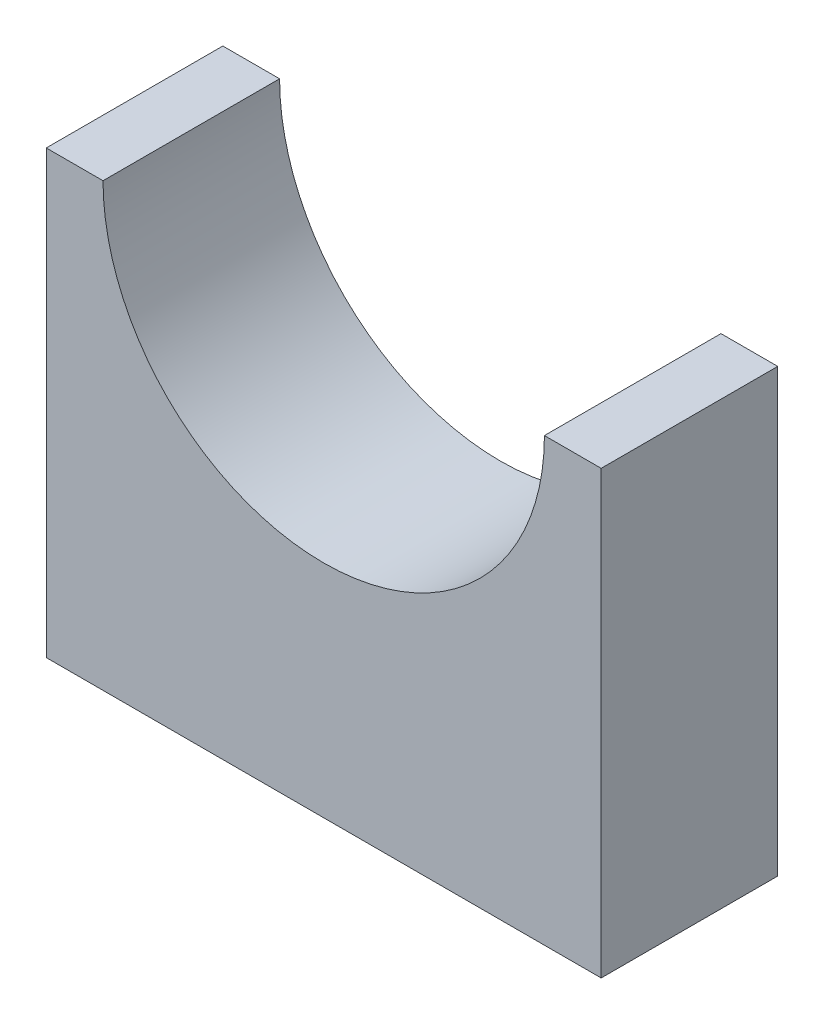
ISO-10303-21;
HEADER;
FILE_DESCRIPTION(('STEP AP214'),'2;1');
FILE_NAME('part.step','',(''),(''),'','','');
FILE_SCHEMA(('AUTOMOTIVE_DESIGN { 1 0 10303 214 1 1 1 1 }'));
ENDSEC;
DATA;
#1=APPLICATION_CONTEXT('core data for automotive mechanical design processes');
#2=APPLICATION_PROTOCOL_DEFINITION('international standard','automotive_design',2000,#1);
#3=PRODUCT_CONTEXT('',#1,'mechanical');
#4=PRODUCT('Part','Part','',(#3));
#5=PRODUCT_RELATED_PRODUCT_CATEGORY('part','',(#4));
#6=PRODUCT_DEFINITION_FORMATION('','',#4);
#7=PRODUCT_DEFINITION_CONTEXT('part definition',#1,'design');
#8=PRODUCT_DEFINITION('design','',#6,#7);
#9=PRODUCT_DEFINITION_SHAPE('','',#8);
#10=(LENGTH_UNIT() NAMED_UNIT(*) SI_UNIT(.MILLI.,.METRE.));
#11=(NAMED_UNIT(*) PLANE_ANGLE_UNIT() SI_UNIT($,.RADIAN.));
#12=(NAMED_UNIT(*) SI_UNIT($,.STERADIAN.) SOLID_ANGLE_UNIT());
#13=UNCERTAINTY_MEASURE_WITH_UNIT(LENGTH_MEASURE(1.E-05),#10,'distance_accuracy_value','');
#14=(GEOMETRIC_REPRESENTATION_CONTEXT(3) GLOBAL_UNCERTAINTY_ASSIGNED_CONTEXT((#13)) GLOBAL_UNIT_ASSIGNED_CONTEXT((#10,
#11,#12)) REPRESENTATION_CONTEXT('',''));
#15=CARTESIAN_POINT('',(0.,0.,0.));
#16=DIRECTION('',(0.,0.,1.));
#17=DIRECTION('',(1.,0.,0.));
#18=AXIS2_PLACEMENT_3D('',#15,#16,#17);
#19=CARTESIAN_POINT('',(-6.14327147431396,6.24753778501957,4.));
#20=DIRECTION('',(1.,0.,0.));
#21=DIRECTION('',(0.,1.,0.));
#22=AXIS2_PLACEMENT_3D('',#19,#20,#21);
#23=PLANE('',#22);
#24=DIRECTION('',(0.,-1.,0.));
#25=VECTOR('',#24,1.);
#26=CARTESIAN_POINT('',(-6.14327147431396,6.24753778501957,0.));
#27=LINE('',#26,#25);
#28=CARTESIAN_POINT('',(-6.14327147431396,6.24753778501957,0.));
#29=VERTEX_POINT('',#28);
#30=CARTESIAN_POINT('',(-6.14327147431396,-3.75246221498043,0.));
#31=VERTEX_POINT('',#30);
#32=EDGE_CURVE('E128',#29,#31,#27,.T.);
#33=ORIENTED_EDGE('',*,*,#32,.T.);
#34=DIRECTION('',(0.,0.,-1.));
#35=VECTOR('',#34,1.);
#36=CARTESIAN_POINT('',(-6.14327147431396,-3.75246221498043,4.));
#37=LINE('',#36,#35);
#38=CARTESIAN_POINT('',(-6.14327147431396,-3.75246221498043,4.));
#39=VERTEX_POINT('',#38);
#40=EDGE_CURVE('E11',#39,#31,#37,.T.);
#41=ORIENTED_EDGE('',*,*,#40,.F.);
#42=DIRECTION('',(0.,-1.,0.));
#43=VECTOR('',#42,1.);
#44=CARTESIAN_POINT('',(-6.14327147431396,6.24753778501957,4.));
#45=LINE('',#44,#43);
#46=CARTESIAN_POINT('',(-6.14327147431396,6.24753778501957,4.));
#47=VERTEX_POINT('',#46);
#48=EDGE_CURVE('E144',#47,#39,#45,.T.);
#49=ORIENTED_EDGE('',*,*,#48,.F.);
#50=DIRECTION('',(0.,0.,-1.));
#51=VECTOR('',#50,1.);
#52=CARTESIAN_POINT('',(-6.14327147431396,6.24753778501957,4.));
#53=LINE('',#52,#51);
#54=EDGE_CURVE('E124',#47,#29,#53,.T.);
#55=ORIENTED_EDGE('',*,*,#54,.T.);
#56=EDGE_LOOP('',(#33,#41,#49,#55));
#57=FACE_BOUND('',#56,.T.);
#58=ADVANCED_FACE('F39',(#57),#23,.F.);
#59=CARTESIAN_POINT('',(-6.14327147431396,-3.75246221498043,4.));
#60=DIRECTION('',(0.,1.,0.));
#61=DIRECTION('',(0.,0.,1.));
#62=AXIS2_PLACEMENT_3D('',#59,#60,#61);
#63=PLANE('',#62);
#64=DIRECTION('',(1.,0.,0.));
#65=VECTOR('',#64,1.);
#66=CARTESIAN_POINT('',(-6.14327147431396,-3.75246221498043,0.));
#67=LINE('',#66,#65);
#68=CARTESIAN_POINT('',(6.42826860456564,-3.75246221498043,0.));
#69=VERTEX_POINT('',#68);
#70=EDGE_CURVE('E132',#31,#69,#67,.T.);
#71=ORIENTED_EDGE('',*,*,#70,.T.);
#72=DIRECTION('',(0.,0.,-1.));
#73=VECTOR('',#72,1.);
#74=CARTESIAN_POINT('',(6.42826860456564,-3.75246221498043,4.));
#75=LINE('',#74,#73);
#76=CARTESIAN_POINT('',(6.42826860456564,-3.75246221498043,4.));
#77=VERTEX_POINT('',#76);
#78=EDGE_CURVE('E48',#77,#69,#75,.T.);
#79=ORIENTED_EDGE('',*,*,#78,.F.);
#80=DIRECTION('',(1.,0.,0.));
#81=VECTOR('',#80,1.);
#82=CARTESIAN_POINT('',(-6.14327147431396,-3.75246221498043,4.));
#83=LINE('',#82,#81);
#84=EDGE_CURVE('E93',#39,#77,#83,.T.);
#85=ORIENTED_EDGE('',*,*,#84,.F.);
#86=ORIENTED_EDGE('',*,*,#40,.T.);
#87=EDGE_LOOP('',(#71,#79,#85,#86));
#88=FACE_BOUND('',#87,.T.);
#89=ADVANCED_FACE('F172',(#88),#63,.F.);
#90=CARTESIAN_POINT('',(6.42826860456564,6.24753778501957,4.));
#91=DIRECTION('',(-1.,0.,0.));
#92=DIRECTION('',(0.,0.,1.));
#93=AXIS2_PLACEMENT_3D('',#90,#91,#92);
#94=PLANE('',#93);
#95=DIRECTION('',(0.,1.,0.));
#96=VECTOR('',#95,1.);
#97=CARTESIAN_POINT('',(6.42826860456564,6.24753778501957,0.));
#98=LINE('',#97,#96);
#99=CARTESIAN_POINT('',(6.42826860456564,6.24753778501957,0.));
#100=VERTEX_POINT('',#99);
#101=EDGE_CURVE('E135',#69,#100,#98,.T.);
#102=ORIENTED_EDGE('',*,*,#101,.T.);
#103=DIRECTION('',(0.,0.,-1.));
#104=VECTOR('',#103,1.);
#105=CARTESIAN_POINT('',(6.42826860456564,6.24753778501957,4.));
#106=LINE('',#105,#104);
#107=CARTESIAN_POINT('',(6.42826860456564,6.24753778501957,4.));
#108=VERTEX_POINT('',#107);
#109=EDGE_CURVE('E117',#108,#100,#106,.T.);
#110=ORIENTED_EDGE('',*,*,#109,.F.);
#111=DIRECTION('',(0.,1.,0.));
#112=VECTOR('',#111,1.);
#113=CARTESIAN_POINT('',(6.42826860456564,6.24753778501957,4.));
#114=LINE('',#113,#112);
#115=EDGE_CURVE('E106',#77,#108,#114,.T.);
#116=ORIENTED_EDGE('',*,*,#115,.F.);
#117=ORIENTED_EDGE('',*,*,#78,.T.);
#118=EDGE_LOOP('',(#102,#110,#116,#117));
#119=FACE_BOUND('',#118,.T.);
#120=ADVANCED_FACE('F154',(#119),#94,.F.);
#121=CARTESIAN_POINT('',(5.14249856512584,6.24753778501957,4.));
#122=DIRECTION('',(0.,-1.,0.));
#123=DIRECTION('',(0.,0.,-1.));
#124=AXIS2_PLACEMENT_3D('',#121,#122,#123);
#125=PLANE('',#124);
#126=DIRECTION('',(-1.,0.,0.));
#127=VECTOR('',#126,1.);
#128=CARTESIAN_POINT('',(5.14249856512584,6.24753778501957,0.));
#129=LINE('',#128,#127);
#130=CARTESIAN_POINT('',(5.14249856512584,6.24753778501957,0.));
#131=VERTEX_POINT('',#130);
#132=EDGE_CURVE('E115',#100,#131,#129,.T.);
#133=ORIENTED_EDGE('',*,*,#132,.T.);
#134=DIRECTION('',(0.,0.,-1.));
#135=VECTOR('',#134,1.);
#136=CARTESIAN_POINT('',(5.14249856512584,6.24753778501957,4.));
#137=LINE('',#136,#135);
#138=CARTESIAN_POINT('',(5.14249856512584,6.24753778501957,4.));
#139=VERTEX_POINT('',#138);
#140=EDGE_CURVE('E112',#139,#131,#137,.T.);
#141=ORIENTED_EDGE('',*,*,#140,.F.);
#142=DIRECTION('',(-1.,0.,0.));
#143=VECTOR('',#142,1.);
#144=CARTESIAN_POINT('',(5.14249856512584,6.24753778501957,4.));
#145=LINE('',#144,#143);
#146=EDGE_CURVE('E100',#108,#139,#145,.T.);
#147=ORIENTED_EDGE('',*,*,#146,.F.);
#148=ORIENTED_EDGE('',*,*,#109,.T.);
#149=EDGE_LOOP('',(#133,#141,#147,#148));
#150=FACE_BOUND('',#149,.T.);
#151=ADVANCED_FACE('F113',(#150),#125,.F.);
#152=CARTESIAN_POINT('',(0.142498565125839,6.24753778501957,4.));
#153=DIRECTION('',(0.,0.,-1.));
#154=DIRECTION('',(-1.,0.,0.));
#155=AXIS2_PLACEMENT_3D('',#152,#153,#154);
#156=CYLINDRICAL_SURFACE('',#155,5.);
#157=CARTESIAN_POINT('',(0.142498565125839,6.24753778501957,0.));
#158=DIRECTION('',(0.,0.,-1.));
#159=DIRECTION('',(1.,0.,0.));
#160=AXIS2_PLACEMENT_3D('',#157,#158,#159);
#161=CIRCLE('',#160,5.);
#162=CARTESIAN_POINT('',(-4.85750143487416,6.24753778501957,0.));
#163=VERTEX_POINT('',#162);
#164=EDGE_CURVE('E79',#131,#163,#161,.T.);
#165=ORIENTED_EDGE('',*,*,#164,.T.);
#166=DIRECTION('',(0.,0.,-1.));
#167=VECTOR('',#166,1.);
#168=CARTESIAN_POINT('',(-4.85750143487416,6.24753778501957,4.));
#169=LINE('',#168,#167);
#170=CARTESIAN_POINT('',(-4.85750143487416,6.24753778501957,4.));
#171=VERTEX_POINT('',#170);
#172=EDGE_CURVE('E118',#171,#163,#169,.T.);
#173=ORIENTED_EDGE('',*,*,#172,.F.);
#174=CARTESIAN_POINT('',(0.142498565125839,6.24753778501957,4.));
#175=DIRECTION('',(0.,0.,-1.));
#176=DIRECTION('',(1.,0.,0.));
#177=AXIS2_PLACEMENT_3D('',#174,#175,#176);
#178=CIRCLE('',#177,5.);
#179=EDGE_CURVE('E104',#139,#171,#178,.T.);
#180=ORIENTED_EDGE('',*,*,#179,.F.);
#181=ORIENTED_EDGE('',*,*,#140,.T.);
#182=EDGE_LOOP('',(#165,#173,#180,#181));
#183=FACE_BOUND('',#182,.T.);
#184=ADVANCED_FACE('F120',(#183),#156,.F.);
#185=CARTESIAN_POINT('',(-6.14327147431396,6.24753778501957,4.));
#186=DIRECTION('',(0.,-1.,0.));
#187=DIRECTION('',(0.,0.,-1.));
#188=AXIS2_PLACEMENT_3D('',#185,#186,#187);
#189=PLANE('',#188);
#190=DIRECTION('',(-1.,0.,0.));
#191=VECTOR('',#190,1.);
#192=CARTESIAN_POINT('',(-6.14327147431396,6.24753778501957,0.));
#193=LINE('',#192,#191);
#194=EDGE_CURVE('E85',#163,#29,#193,.T.);
#195=ORIENTED_EDGE('',*,*,#194,.T.);
#196=ORIENTED_EDGE('',*,*,#54,.F.);
#197=DIRECTION('',(-1.,0.,0.));
#198=VECTOR('',#197,1.);
#199=CARTESIAN_POINT('',(-6.14327147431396,6.24753778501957,4.));
#200=LINE('',#199,#198);
#201=EDGE_CURVE('E56',#171,#47,#200,.T.);
#202=ORIENTED_EDGE('',*,*,#201,.F.);
#203=ORIENTED_EDGE('',*,*,#172,.T.);
#204=EDGE_LOOP('',(#195,#196,#202,#203));
#205=FACE_BOUND('',#204,.T.);
#206=ADVANCED_FACE('F161',(#205),#189,.F.);
#207=CARTESIAN_POINT('',(0.142498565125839,6.24753778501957,4.));
#208=DIRECTION('',(0.,0.,1.));
#209=DIRECTION('',(1.,0.,0.));
#210=AXIS2_PLACEMENT_3D('',#207,#208,#209);
#211=PLANE('',#210);
#212=ORIENTED_EDGE('',*,*,#48,.T.);
#213=ORIENTED_EDGE('',*,*,#84,.T.);
#214=ORIENTED_EDGE('',*,*,#115,.T.);
#215=ORIENTED_EDGE('',*,*,#146,.T.);
#216=ORIENTED_EDGE('',*,*,#179,.T.);
#217=ORIENTED_EDGE('',*,*,#201,.T.);
#218=EDGE_LOOP('',(#212,#213,#214,#215,#216,#217));
#219=FACE_BOUND('',#218,.T.);
#220=ADVANCED_FACE('F102',(#219),#211,.T.);
#221=CARTESIAN_POINT('',(0.142498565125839,6.24753778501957,0.));
#222=DIRECTION('',(0.,0.,1.));
#223=DIRECTION('',(1.,0.,0.));
#224=AXIS2_PLACEMENT_3D('',#221,#222,#223);
#225=PLANE('',#224);
#226=ORIENTED_EDGE('',*,*,#32,.F.);
#227=ORIENTED_EDGE('',*,*,#194,.F.);
#228=ORIENTED_EDGE('',*,*,#164,.F.);
#229=ORIENTED_EDGE('',*,*,#132,.F.);
#230=ORIENTED_EDGE('',*,*,#101,.F.);
#231=ORIENTED_EDGE('',*,*,#70,.F.);
#232=EDGE_LOOP('',(#226,#227,#228,#229,#230,#231));
#233=FACE_BOUND('',#232,.T.);
#234=ADVANCED_FACE('F157',(#233),#225,.F.);
#235=CLOSED_SHELL('',(#58,#89,#120,#151,#184,#206,#220,#234));
#236=MANIFOLD_SOLID_BREP('B2',#235);
#237=ADVANCED_BREP_SHAPE_REPRESENTATION('',(#18,#236),#14);
#238=SHAPE_DEFINITION_REPRESENTATION(#9,#237);
ENDSEC;
END-ISO-10303-21;
